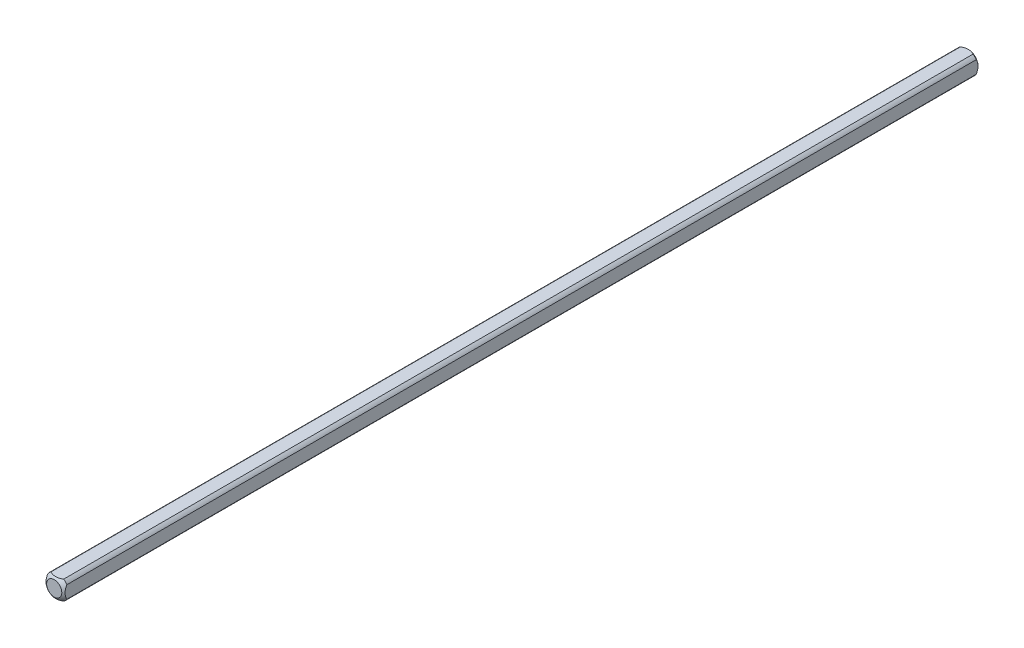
from build123d import *

# Parameters (mm, degrees)
SKETCH1_W           = 6.35
SKETCH1_H           = 6.35
BOSS_EXTRUDE1_DEPTH = 152.4
SKETCH2_OUTSIDE_W   = 38.882
SKETCH2_OUTSIDE_H   = 38.882
SKETCH2_OUTSIDE_R   = 3.81
CUT_EXTRUDE1_DEPTH  = 153.466131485


with BuildPart() as part:
    # Sketch1 → Boss-Extrude1 (new body)
    with BuildSketch(Plane.XY):
        Rectangle(SKETCH1_W, SKETCH1_H)
    extrude(amount=BOSS_EXTRUDE1_DEPTH)

    # Sketch2 outside → Cut-Extrude1 (cut, through all)
    with BuildSketch(Plane(origin=(0, 0, 0), x_dir=(-1, 0, 0), z_dir=(0, 0, -1))):
        Rectangle(SKETCH2_OUTSIDE_W, SKETCH2_OUTSIDE_H)
        Circle(SKETCH2_OUTSIDE_R, mode=Mode.SUBTRACT)
    extrude(amount=-CUT_EXTRUDE1_DEPTH, mode=Mode.SUBTRACT)

    # Sketch3 → Cut-Revolve1 (revolve, cut)
    with BuildSketch(Plane(origin=(0, 0, 0), x_dir=(1, 0, 0), z_dir=(0, 1, 0))):
        with BuildLine():
            Line((-5.053685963, -3.893335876), (-5.053685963, 5.740530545))
            Line((-5.053685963, 5.740530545), (0, 5.740530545))
            Line((0, 5.740530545), (0, 0.670274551))
            ThreePointArc((0, 0.670274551), (-3.404639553, -0.639469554), (-5.053685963, -3.893335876))
        make_face()
    revolve(axis=Axis((0, 0, 152.4), (0, 0, -1)), mode=Mode.SUBTRACT)

    # Mirror1: part across plane


with BuildPart() as part_1:
    add(part.part)
    add(part.part.mirror(Plane(origin=(0, 0, 152.4), x_dir=(1, 0, 0), z_dir=(0, 0, -1))))


solid = part_1.part
